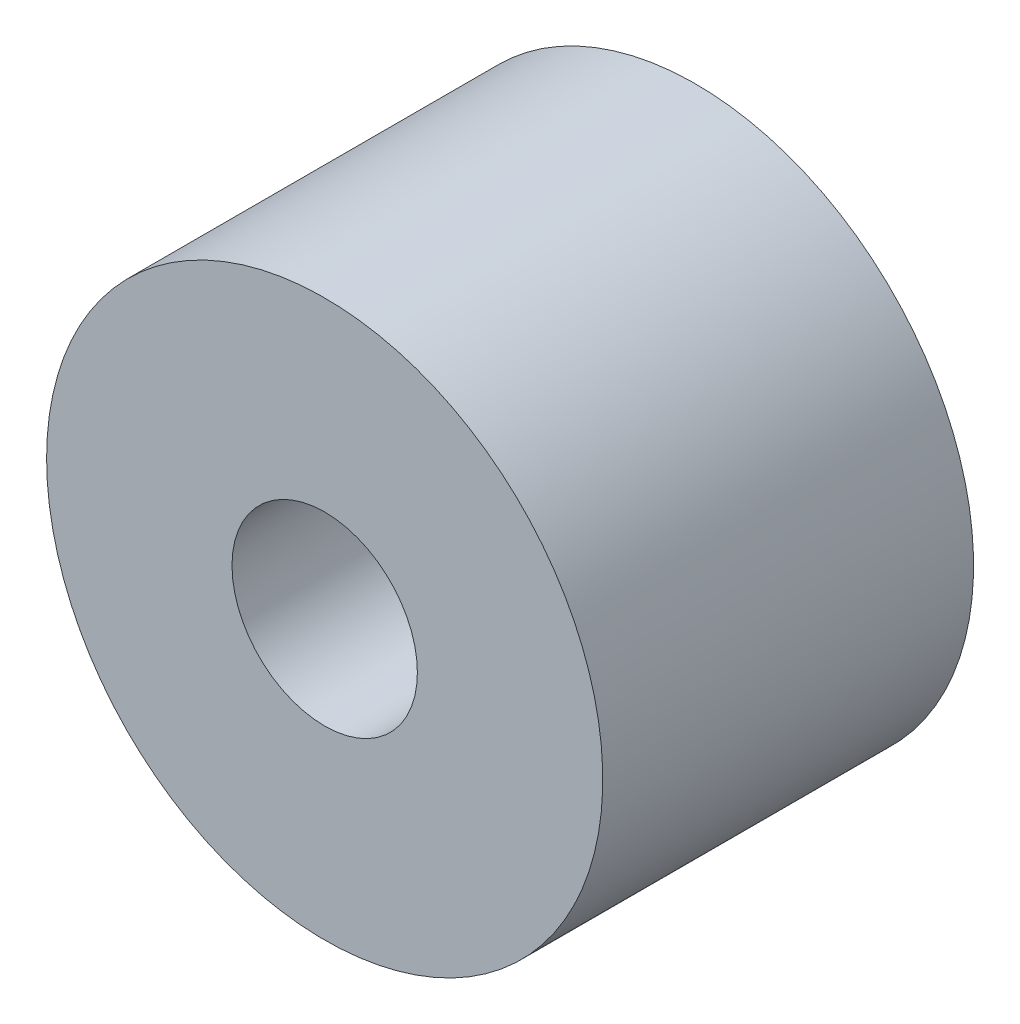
ISO-10303-21;
HEADER;
FILE_DESCRIPTION(('STEP AP214'),'2;1');
FILE_NAME('part.step','',(''),(''),'','','');
FILE_SCHEMA(('AUTOMOTIVE_DESIGN { 1 0 10303 214 1 1 1 1 }'));
ENDSEC;
DATA;
#1=APPLICATION_CONTEXT('core data for automotive mechanical design processes');
#2=APPLICATION_PROTOCOL_DEFINITION('international standard','automotive_design',2000,#1);
#3=PRODUCT_CONTEXT('',#1,'mechanical');
#4=PRODUCT('Part','Part','',(#3));
#5=PRODUCT_RELATED_PRODUCT_CATEGORY('part','',(#4));
#6=PRODUCT_DEFINITION_FORMATION('','',#4);
#7=PRODUCT_DEFINITION_CONTEXT('part definition',#1,'design');
#8=PRODUCT_DEFINITION('design','',#6,#7);
#9=PRODUCT_DEFINITION_SHAPE('','',#8);
#10=(LENGTH_UNIT() NAMED_UNIT(*) SI_UNIT(.MILLI.,.METRE.));
#11=(NAMED_UNIT(*) PLANE_ANGLE_UNIT() SI_UNIT($,.RADIAN.));
#12=(NAMED_UNIT(*) SI_UNIT($,.STERADIAN.) SOLID_ANGLE_UNIT());
#13=UNCERTAINTY_MEASURE_WITH_UNIT(LENGTH_MEASURE(1.E-05),#10,'distance_accuracy_value','');
#14=(GEOMETRIC_REPRESENTATION_CONTEXT(3) GLOBAL_UNCERTAINTY_ASSIGNED_CONTEXT((#13)) GLOBAL_UNIT_ASSIGNED_CONTEXT((#10,
#11,#12)) REPRESENTATION_CONTEXT('',''));
#15=CARTESIAN_POINT('',(0.,0.,0.));
#16=DIRECTION('',(0.,0.,1.));
#17=DIRECTION('',(1.,0.,0.));
#18=AXIS2_PLACEMENT_3D('',#15,#16,#17);
#19=CARTESIAN_POINT('',(0.,-1.5,3.));
#20=DIRECTION('',(0.,0.,-1.));
#21=DIRECTION('',(-1.,0.,0.));
#22=AXIS2_PLACEMENT_3D('',#19,#20,#21);
#23=PLANE('',#22);
#24=CARTESIAN_POINT('',(0.,0.,3.));
#25=DIRECTION('',(0.,0.,-1.));
#26=DIRECTION('',(-1.,0.,0.));
#27=AXIS2_PLACEMENT_3D('',#24,#25,#26);
#28=CIRCLE('',#27,4.5);
#29=CARTESIAN_POINT('',(-4.5,0.,3.));
#30=VERTEX_POINT('',#29);
#31=EDGE_CURVE('E10',#30,#30,#28,.T.);
#32=ORIENTED_EDGE('',*,*,#31,.F.);
#33=EDGE_LOOP('',(#32));
#34=FACE_BOUND('',#33,.T.);
#35=CARTESIAN_POINT('',(0.,0.,3.));
#36=DIRECTION('',(0.,0.,-1.));
#37=DIRECTION('',(-1.,0.,0.));
#38=AXIS2_PLACEMENT_3D('',#35,#36,#37);
#39=CIRCLE('',#38,1.5);
#40=CARTESIAN_POINT('',(-1.5,0.,3.));
#41=VERTEX_POINT('',#40);
#42=EDGE_CURVE('E45',#41,#41,#39,.T.);
#43=ORIENTED_EDGE('',*,*,#42,.T.);
#44=EDGE_LOOP('',(#43));
#45=FACE_BOUND('',#44,.T.);
#46=ADVANCED_FACE('F31',(#34,#45),#23,.F.);
#47=CARTESIAN_POINT('',(0.,0.,0.));
#48=DIRECTION('',(0.,0.,-1.));
#49=DIRECTION('',(-1.,0.,0.));
#50=AXIS2_PLACEMENT_3D('',#47,#48,#49);
#51=CYLINDRICAL_SURFACE('',#50,4.5);
#52=CARTESIAN_POINT('',(0.,0.,-3.));
#53=DIRECTION('',(0.,0.,-1.));
#54=DIRECTION('',(-1.,0.,0.));
#55=AXIS2_PLACEMENT_3D('',#52,#53,#54);
#56=CIRCLE('',#55,4.5);
#57=CARTESIAN_POINT('',(-4.5,0.,-3.));
#58=VERTEX_POINT('',#57);
#59=EDGE_CURVE('E37',#58,#58,#56,.T.);
#60=ORIENTED_EDGE('',*,*,#59,.F.);
#61=EDGE_LOOP('',(#60));
#62=FACE_BOUND('',#61,.T.);
#63=ORIENTED_EDGE('',*,*,#31,.T.);
#64=EDGE_LOOP('',(#63));
#65=FACE_BOUND('',#64,.T.);
#66=ADVANCED_FACE('F60',(#62,#65),#51,.T.);
#67=CARTESIAN_POINT('',(0.,-1.5,-3.));
#68=DIRECTION('',(0.,0.,1.));
#69=DIRECTION('',(1.,0.,0.));
#70=AXIS2_PLACEMENT_3D('',#67,#68,#69);
#71=PLANE('',#70);
#72=CARTESIAN_POINT('',(0.,0.,-3.));
#73=DIRECTION('',(0.,0.,-1.));
#74=DIRECTION('',(-1.,0.,0.));
#75=AXIS2_PLACEMENT_3D('',#72,#73,#74);
#76=CIRCLE('',#75,1.5);
#77=CARTESIAN_POINT('',(-1.5,0.,-3.));
#78=VERTEX_POINT('',#77);
#79=EDGE_CURVE('E41',#78,#78,#76,.T.);
#80=ORIENTED_EDGE('',*,*,#79,.F.);
#81=EDGE_LOOP('',(#80));
#82=FACE_BOUND('',#81,.T.);
#83=ORIENTED_EDGE('',*,*,#59,.T.);
#84=EDGE_LOOP('',(#83));
#85=FACE_BOUND('',#84,.T.);
#86=ADVANCED_FACE('F55',(#82,#85),#71,.F.);
#87=CARTESIAN_POINT('',(0.,0.,0.));
#88=DIRECTION('',(0.,0.,-1.));
#89=DIRECTION('',(-1.,0.,0.));
#90=AXIS2_PLACEMENT_3D('',#87,#88,#89);
#91=CYLINDRICAL_SURFACE('',#90,1.5);
#92=ORIENTED_EDGE('',*,*,#42,.F.);
#93=EDGE_LOOP('',(#92));
#94=FACE_BOUND('',#93,.T.);
#95=ORIENTED_EDGE('',*,*,#79,.T.);
#96=EDGE_LOOP('',(#95));
#97=FACE_BOUND('',#96,.T.);
#98=ADVANCED_FACE('F52',(#94,#97),#91,.F.);
#99=CLOSED_SHELL('',(#46,#66,#86,#98));
#100=MANIFOLD_SOLID_BREP('B2',#99);
#101=ADVANCED_BREP_SHAPE_REPRESENTATION('',(#18,#100),#14);
#102=SHAPE_DEFINITION_REPRESENTATION(#9,#101);
ENDSEC;
END-ISO-10303-21;
